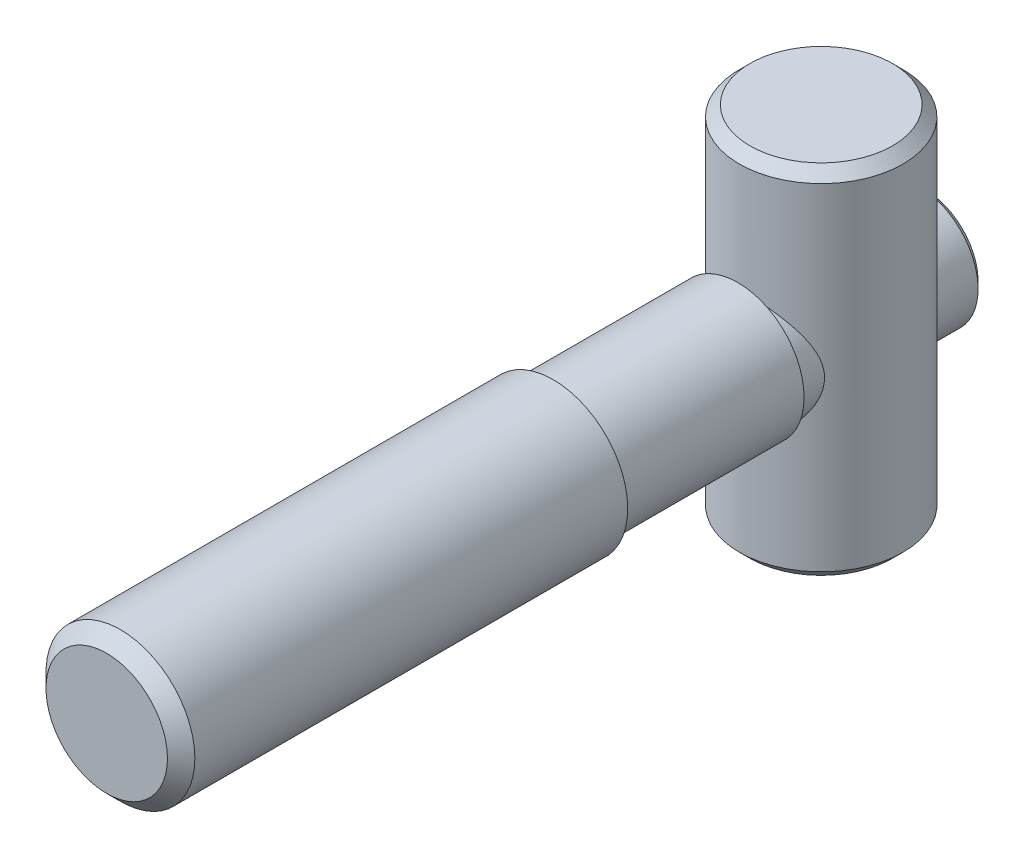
ISO-10303-21;
HEADER;
FILE_DESCRIPTION(('STEP AP214'),'2;1');
FILE_NAME('part.step','',(''),(''),'','','');
FILE_SCHEMA(('AUTOMOTIVE_DESIGN { 1 0 10303 214 1 1 1 1 }'));
ENDSEC;
DATA;
#1=APPLICATION_CONTEXT('core data for automotive mechanical design processes');
#2=APPLICATION_PROTOCOL_DEFINITION('international standard','automotive_design',2000,#1);
#3=PRODUCT_CONTEXT('',#1,'mechanical');
#4=PRODUCT('Part','Part','',(#3));
#5=PRODUCT_RELATED_PRODUCT_CATEGORY('part','',(#4));
#6=PRODUCT_DEFINITION_FORMATION('','',#4);
#7=PRODUCT_DEFINITION_CONTEXT('part definition',#1,'design');
#8=PRODUCT_DEFINITION('design','',#6,#7);
#9=PRODUCT_DEFINITION_SHAPE('','',#8);
#10=(LENGTH_UNIT() NAMED_UNIT(*) SI_UNIT(.MILLI.,.METRE.));
#11=(NAMED_UNIT(*) PLANE_ANGLE_UNIT() SI_UNIT($,.RADIAN.));
#12=(NAMED_UNIT(*) SI_UNIT($,.STERADIAN.) SOLID_ANGLE_UNIT());
#13=UNCERTAINTY_MEASURE_WITH_UNIT(LENGTH_MEASURE(1.E-05),#10,'distance_accuracy_value','');
#14=(GEOMETRIC_REPRESENTATION_CONTEXT(3) GLOBAL_UNCERTAINTY_ASSIGNED_CONTEXT((#13)) GLOBAL_UNIT_ASSIGNED_CONTEXT((#10,
#11,#12)) REPRESENTATION_CONTEXT('',''));
#15=CARTESIAN_POINT('',(0.,0.,0.));
#16=DIRECTION('',(0.,0.,1.));
#17=DIRECTION('',(1.,0.,0.));
#18=AXIS2_PLACEMENT_3D('',#15,#16,#17);
#19=CARTESIAN_POINT('',(0.,-12.,-18.3));
#20=DIRECTION('',(0.,-1.,0.));
#21=DIRECTION('',(-1.,0.,0.));
#22=AXIS2_PLACEMENT_3D('',#19,#20,#21);
#23=PLANE('',#22);
#24=CARTESIAN_POINT('',(0.,-12.,-18.3));
#25=DIRECTION('',(0.,-1.,0.));
#26=DIRECTION('',(-1.,0.,0.));
#27=AXIS2_PLACEMENT_3D('',#24,#25,#26);
#28=CIRCLE('',#27,4.79289321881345);
#29=CARTESIAN_POINT('',(-4.79289321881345,-12.,-18.3));
#30=VERTEX_POINT('',#29);
#31=EDGE_CURVE('E145',#30,#30,#28,.T.);
#32=ORIENTED_EDGE('',*,*,#31,.T.);
#33=EDGE_LOOP('',(#32));
#34=FACE_BOUND('',#33,.T.);
#35=ADVANCED_FACE('F14',(#34),#23,.T.);
#36=CARTESIAN_POINT('',(0.,12.,-18.3));
#37=DIRECTION('',(0.,1.,0.));
#38=DIRECTION('',(1.,0.,0.));
#39=AXIS2_PLACEMENT_3D('',#36,#37,#38);
#40=PLANE('',#39);
#41=CARTESIAN_POINT('',(0.,12.,-18.3));
#42=DIRECTION('',(0.,1.,0.));
#43=DIRECTION('',(1.,0.,0.));
#44=AXIS2_PLACEMENT_3D('',#41,#42,#43);
#45=CIRCLE('',#44,4.79289321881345);
#46=CARTESIAN_POINT('',(4.79289321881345,12.,-18.3));
#47=VERTEX_POINT('',#46);
#48=EDGE_CURVE('E9',#47,#47,#45,.T.);
#49=ORIENTED_EDGE('',*,*,#48,.T.);
#50=EDGE_LOOP('',(#49));
#51=FACE_BOUND('',#50,.T.);
#52=ADVANCED_FACE('F181',(#51),#40,.T.);
#53=CARTESIAN_POINT('',(0.,-12.,-18.3));
#54=DIRECTION('',(0.,1.,0.));
#55=DIRECTION('',(1.,0.,0.));
#56=AXIS2_PLACEMENT_3D('',#53,#54,#55);
#57=CONICAL_SURFACE('',#56,4.79289321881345,0.785398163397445);
#58=CARTESIAN_POINT('',(0.,-11.2928932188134,-18.3));
#59=DIRECTION('',(0.,-1.,0.));
#60=DIRECTION('',(-1.,0.,0.));
#61=AXIS2_PLACEMENT_3D('',#58,#59,#60);
#62=CIRCLE('',#61,5.5);
#63=CARTESIAN_POINT('',(-5.5,-11.2928932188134,-18.3));
#64=VERTEX_POINT('',#63);
#65=EDGE_CURVE('E23',#64,#64,#62,.F.);
#66=ORIENTED_EDGE('',*,*,#65,.F.);
#67=EDGE_LOOP('',(#66));
#68=FACE_BOUND('',#67,.T.);
#69=ORIENTED_EDGE('',*,*,#31,.F.);
#70=EDGE_LOOP('',(#69));
#71=FACE_BOUND('',#70,.T.);
#72=ADVANCED_FACE('F183',(#68,#71),#57,.T.);
#73=CARTESIAN_POINT('',(0.,12.,-18.3));
#74=DIRECTION('',(0.,-1.,0.));
#75=DIRECTION('',(-1.,0.,0.));
#76=AXIS2_PLACEMENT_3D('',#73,#74,#75);
#77=CONICAL_SURFACE('',#76,4.79289321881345,0.785398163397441);
#78=CARTESIAN_POINT('',(0.,11.2928932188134,-18.3));
#79=DIRECTION('',(0.,1.,0.));
#80=DIRECTION('',(1.,0.,0.));
#81=AXIS2_PLACEMENT_3D('',#78,#79,#80);
#82=CIRCLE('',#81,5.5);
#83=CARTESIAN_POINT('',(5.5,11.2928932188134,-18.3));
#84=VERTEX_POINT('',#83);
#85=EDGE_CURVE('E149',#84,#84,#82,.F.);
#86=ORIENTED_EDGE('',*,*,#85,.F.);
#87=EDGE_LOOP('',(#86));
#88=FACE_BOUND('',#87,.T.);
#89=ORIENTED_EDGE('',*,*,#48,.F.);
#90=EDGE_LOOP('',(#89));
#91=FACE_BOUND('',#90,.T.);
#92=ADVANCED_FACE('F174',(#88,#91),#77,.T.);
#93=CARTESIAN_POINT('',(0.,12.,-18.3));
#94=DIRECTION('',(0.,1.,0.));
#95=DIRECTION('',(1.,0.,0.));
#96=AXIS2_PLACEMENT_3D('',#93,#94,#95);
#97=CYLINDRICAL_SURFACE('',#96,5.5);
#98=DIRECTION('',(0.,1.,0.));
#99=VECTOR('',#98,1.);
#100=CARTESIAN_POINT('',(0.6,12.,-23.7671747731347));
#101=LINE('',#100,#99);
#102=CARTESIAN_POINT('',(0.6,-3.95474398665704,-23.7671747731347));
#103=VERTEX_POINT('',#102);
#104=CARTESIAN_POINT('',(0.6,3.95474398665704,-23.7671747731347));
#105=VERTEX_POINT('',#104);
#106=EDGE_CURVE('E81',#103,#105,#101,.T.);
#107=ORIENTED_EDGE('',*,*,#106,.F.);
#108=CARTESIAN_POINT('',(4.,0.,-22.0749172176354));
#109=CARTESIAN_POINT('',(3.99999971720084,0.094559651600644,-22.0749177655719));
#110=CARTESIAN_POINT('',(3.99663873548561,0.189122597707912,-22.078488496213));
#111=CARTESIAN_POINT('',(3.98328406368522,0.377297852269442,-22.0925637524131));
#112=CARTESIAN_POINT('',(3.97328671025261,0.470909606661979,-22.1030721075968));
#113=CARTESIAN_POINT('',(3.94687649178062,0.65648336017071,-22.1304732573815));
#114=CARTESIAN_POINT('',(3.93044906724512,0.748441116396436,-22.1473805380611));
#115=CARTESIAN_POINT('',(3.89152450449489,0.929870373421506,-22.1867470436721));
#116=CARTESIAN_POINT('',(3.86902376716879,1.01934036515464,-22.2092095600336));
#117=CARTESIAN_POINT('',(3.79365509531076,1.28093397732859,-22.2828450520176));
#118=CARTESIAN_POINT('',(3.73252985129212,1.44885844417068,-22.3407009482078));
#119=CARTESIAN_POINT('',(3.590688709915,1.77146295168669,-22.4672506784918));
#120=CARTESIAN_POINT('',(3.50997431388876,1.92614400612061,-22.5359436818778));
#121=CARTESIAN_POINT('',(3.31318173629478,2.25065582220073,-22.6922095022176));
#122=CARTESIAN_POINT('',(3.19328494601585,2.41764951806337,-22.7808675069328));
#123=CARTESIAN_POINT('',(2.92908108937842,2.73178094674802,-22.9578760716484));
#124=CARTESIAN_POINT('',(2.78474090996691,2.87889125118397,-23.0462260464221));
#125=CARTESIAN_POINT('',(2.5362822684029,3.09553636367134,-23.1814353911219));
#126=CARTESIAN_POINT('',(2.43963284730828,3.17231415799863,-23.2305740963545));
#127=CARTESIAN_POINT('',(2.23844845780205,3.31733570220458,-23.3251054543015));
#128=CARTESIAN_POINT('',(2.13391712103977,3.38558334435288,-23.3704998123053));
#129=CARTESIAN_POINT('',(1.91752007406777,3.51266692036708,-23.4562228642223));
#130=CARTESIAN_POINT('',(1.80566515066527,3.57151627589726,-23.49655876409));
#131=CARTESIAN_POINT('',(1.57523382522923,3.67896799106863,-23.5709873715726));
#132=CARTESIAN_POINT('',(1.45666071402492,3.72757531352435,-23.6050831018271));
#133=CARTESIAN_POINT('',(1.16188171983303,3.83193503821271,-23.678830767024));
#134=CARTESIAN_POINT('',(0.982606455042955,3.88193864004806,-23.7146815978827));
#135=CARTESIAN_POINT('',(0.616370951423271,3.95663720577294,-23.7684829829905));
#136=CARTESIAN_POINT('',(0.429417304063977,3.98135342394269,-23.7864485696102));
#137=CARTESIAN_POINT('',(0.052567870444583,4.00411402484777,-23.8029868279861));
#138=CARTESIAN_POINT('',(-0.137333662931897,4.00209732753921,-23.8015150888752));
#139=CARTESIAN_POINT('',(-0.51380986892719,3.97135939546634,-23.7791958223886));
#140=CARTESIAN_POINT('',(-0.700383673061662,3.94263129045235,-23.7583433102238));
#141=CARTESIAN_POINT('',(-1.05962164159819,3.86136821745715,-23.699944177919));
#142=CARTESIAN_POINT('',(-1.23253206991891,3.80954610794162,-23.6628980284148));
#143=CARTESIAN_POINT('',(-1.56671343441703,3.68473335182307,-23.5749694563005));
#144=CARTESIAN_POINT('',(-1.72798199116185,3.61173839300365,-23.5240842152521));
#145=CARTESIAN_POINT('',(-2.05370310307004,3.43803005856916,-23.4054456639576));
#146=CARTESIAN_POINT('',(-2.2165364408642,3.33514439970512,-23.3364494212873));
#147=CARTESIAN_POINT('',(-2.52348319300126,3.10940476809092,-23.189889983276));
#148=CARTESIAN_POINT('',(-2.66757825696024,2.98653148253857,-23.1123185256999));
#149=CARTESIAN_POINT('',(-2.96150593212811,2.69807007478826,-22.9383041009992));
#150=CARTESIAN_POINT('',(-3.10726104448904,2.52879913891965,-22.8410685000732));
#151=CARTESIAN_POINT('',(-3.36953999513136,2.16705523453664,-22.6499971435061));
#152=CARTESIAN_POINT('',(-3.48605965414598,1.97457895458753,-22.556161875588));
#153=CARTESIAN_POINT('',(-3.66526169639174,1.61165125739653,-22.402032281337));
#154=CARTESIAN_POINT('',(-3.73414032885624,1.44549066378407,-22.3388789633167));
#155=CARTESIAN_POINT('',(-3.84985589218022,1.10068331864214,-22.2287430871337));
#156=CARTESIAN_POINT('',(-3.89674227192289,0.922065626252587,-22.1817243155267));
#157=CARTESIAN_POINT('',(-3.9599937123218,0.585461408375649,-22.1170906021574));
#158=CARTESIAN_POINT('',(-3.98009730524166,0.428880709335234,-22.0959235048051));
#159=CARTESIAN_POINT('',(-4.00152507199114,0.113064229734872,-22.0733369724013));
#160=CARTESIAN_POINT('',(-4.00286519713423,-0.0461691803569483,-22.0719007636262));
#161=CARTESIAN_POINT('',(-3.98669865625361,-0.362327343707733,-22.0889767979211));
#162=CARTESIAN_POINT('',(-3.96921589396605,-0.519254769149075,-22.1074637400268));
#163=CARTESIAN_POINT('',(-3.91666535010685,-0.82717652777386,-22.1614916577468));
#164=CARTESIAN_POINT('',(-3.88157034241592,-0.978161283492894,-22.1970590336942));
#165=CARTESIAN_POINT('',(-3.77812999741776,-1.33113055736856,-22.2978469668));
#166=CARTESIAN_POINT('',(-3.70207893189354,-1.52906623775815,-22.3692423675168));
#167=CARTESIAN_POINT('',(-3.52270580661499,-1.90640842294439,-22.5254840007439));
#168=CARTESIAN_POINT('',(-3.41932922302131,-2.08577687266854,-22.6103569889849));
#169=CARTESIAN_POINT('',(-3.18411833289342,-2.43025180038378,-22.7870574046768));
#170=CARTESIAN_POINT('',(-3.05152555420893,-2.59477148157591,-22.8790168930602));
#171=CARTESIAN_POINT('',(-2.76125147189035,-2.90173861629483,-23.059699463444));
#172=CARTESIAN_POINT('',(-2.6035911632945,-3.04420434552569,-23.1484251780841));
#173=CARTESIAN_POINT('',(-2.271539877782,-3.2987599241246,-23.3122631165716));
#174=CARTESIAN_POINT('',(-2.09818660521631,-3.41190835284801,-23.3878018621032));
#175=CARTESIAN_POINT('',(-1.82330793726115,-3.56180731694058,-23.4899086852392));
#176=CARTESIAN_POINT('',(-1.72916099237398,-3.6084863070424,-23.5220894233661));
#177=CARTESIAN_POINT('',(-1.53632285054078,-3.69470582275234,-23.5820343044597));
#178=CARTESIAN_POINT('',(-1.43763386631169,-3.73424977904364,-23.6098005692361));
#179=CARTESIAN_POINT('',(-1.23534308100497,-3.80598862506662,-23.6604944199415));
#180=CARTESIAN_POINT('',(-1.13170490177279,-3.83811376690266,-23.683375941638));
#181=CARTESIAN_POINT('',(-0.921160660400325,-3.89401032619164,-23.7233693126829));
#182=CARTESIAN_POINT('',(-0.81425636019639,-3.9177861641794,-23.7404842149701));
#183=CARTESIAN_POINT('',(-0.598125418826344,-3.95655048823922,-23.7684652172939));
#184=CARTESIAN_POINT('',(-0.488900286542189,-3.9715445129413,-23.7793352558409));
#185=CARTESIAN_POINT('',(-0.269138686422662,-3.9924605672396,-23.7945144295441));
#186=CARTESIAN_POINT('',(-0.15860243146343,-3.99838404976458,-23.7988246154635));
#187=CARTESIAN_POINT('',(0.0467313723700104,-4.00084937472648,-23.8006178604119));
#188=CARTESIAN_POINT('',(0.141509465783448,-3.99861635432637,-23.7989924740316));
#189=CARTESIAN_POINT('',(0.330490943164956,-3.98744748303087,-23.7908762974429));
#190=CARTESIAN_POINT('',(0.424694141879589,-3.97850957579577,-23.7843840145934));
#191=CARTESIAN_POINT('',(0.611759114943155,-3.95406659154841,-23.7666782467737));
#192=CARTESIAN_POINT('',(0.704621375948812,-3.93856396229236,-23.7554665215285));
#193=CARTESIAN_POINT('',(0.88841574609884,-3.90122128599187,-23.7285691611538));
#194=CARTESIAN_POINT('',(0.979347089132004,-3.87937877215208,-23.7128817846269));
#195=CARTESIAN_POINT('',(1.24445933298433,-3.80583624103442,-23.6603363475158));
#196=CARTESIAN_POINT('',(1.41518501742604,-3.74554675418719,-23.6175701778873));
#197=CARTESIAN_POINT('',(1.74369677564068,-3.60438289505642,-23.5191022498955));
#198=CARTESIAN_POINT('',(1.90148075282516,-3.5235051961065,-23.4633984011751));
#199=CARTESIAN_POINT('',(2.22228203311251,-3.33179335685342,-23.3343972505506));
#200=CARTESIAN_POINT('',(2.38322541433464,-3.21841054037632,-23.2597469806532));
#201=CARTESIAN_POINT('',(2.68497920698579,-2.97136345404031,-23.103106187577));
#202=CARTESIAN_POINT('',(2.82576198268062,-2.8376718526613,-23.0211058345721));
#203=CARTESIAN_POINT('',(3.03332548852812,-2.61000808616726,-22.8888332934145));
#204=CARTESIAN_POINT('',(3.10699576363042,-2.5218601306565,-22.839152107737));
#205=CARTESIAN_POINT('',(3.24665706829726,-2.3393224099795,-22.7403298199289));
#206=CARTESIAN_POINT('',(3.31264615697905,-2.24493107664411,-22.69118885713));
#207=CARTESIAN_POINT('',(3.43660180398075,-2.0501419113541,-22.5948719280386));
#208=CARTESIAN_POINT('',(3.49457298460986,-1.94974758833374,-22.5476948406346));
#209=CARTESIAN_POINT('',(3.6021255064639,-1.74306577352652,-22.4568795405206));
#210=CARTESIAN_POINT('',(3.6517073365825,-1.63677862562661,-22.4132411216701));
#211=CARTESIAN_POINT('',(3.76078752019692,-1.37275858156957,-22.3142162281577));
#212=CARTESIAN_POINT('',(3.81580236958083,-1.21205137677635,-22.2615166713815));
#213=CARTESIAN_POINT('',(3.88309107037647,-0.963817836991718,-22.1952018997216));
#214=CARTESIAN_POINT('',(3.90296834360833,-0.879972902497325,-22.1752342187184));
#215=CARTESIAN_POINT('',(3.93739985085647,-0.710192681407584,-22.1402454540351));
#216=CARTESIAN_POINT('',(3.95195647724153,-0.62425835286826,-22.1252221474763));
#217=CARTESIAN_POINT('',(3.97571410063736,-0.449073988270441,-22.1005263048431));
#218=CARTESIAN_POINT('',(3.98480070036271,-0.359792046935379,-22.0909682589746));
#219=CARTESIAN_POINT('',(3.99694447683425,-0.180341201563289,-22.0781627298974));
#220=CARTESIAN_POINT('',(4.00000026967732,-0.0901720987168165,-22.0749166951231));
#221=CARTESIAN_POINT('',(4.,0.,-22.0749172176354));
#222=B_SPLINE_CURVE_WITH_KNOTS('',3,(#108,#109,#110,#111,#112,#113,#114,#115,#116,#117,#118,
#119,#120,#121,#122,#123,#124,#125,#126,#127,#128,#129,#130,#131,#132,#133,#134,#135,#136,#137,
#138,#139,#140,#141,#142,#143,#144,#145,#146,#147,#148,#149,#150,#151,#152,#153,#154,#155,#156,
#157,#158,#159,#160,#161,#162,#163,#164,#165,#166,#167,#168,#169,#170,#171,#172,#173,#174,#175,
#176,#177,#178,#179,#180,#181,#182,#183,#184,#185,#186,#187,#188,#189,#190,#191,#192,#193,#194,
#195,#196,#197,#198,#199,#200,#201,#202,#203,#204,#205,#206,#207,#208,#209,#210,#211,#212,#213,
#214,#215,#216,#217,#218,#219,#220,#221),.UNSPECIFIED.,.T.,.F.,(4,2,2,2,2,2,2,2,2,2,2,2,2,2,2,2,
2,2,2,2,2,2,2,2,2,2,2,2,2,2,2,2,2,2,2,2,2,2,2,2,2,2,2,2,2,2,2,2,2,2,2,2,2,2,2,2,4),(0.,
0.283560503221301,0.567277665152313,0.851640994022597,1.13617321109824,1.69729774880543,
2.25837929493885,2.92774006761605,3.59801497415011,3.99610080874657,4.39400433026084,
4.79133442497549,5.18847154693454,5.75445889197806,6.31997012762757,6.88677367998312,
7.45372305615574,8.00426875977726,8.5549266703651,9.16646484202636,9.77859745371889,
10.5066073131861,11.2347211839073,11.8047550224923,12.3735009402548,12.8491941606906,
13.3244829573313,13.7991688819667,14.2745908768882,14.94214771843,15.6110467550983,
16.2999460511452,16.9882713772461,17.6463931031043,17.9757519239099,18.3049519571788,
18.6371312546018,18.9691344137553,19.3009279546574,19.6326683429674,19.9167672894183,
20.2009534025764,20.4850336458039,20.7692245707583,21.3249022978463,21.8806698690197,
22.5100347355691,23.1402542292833,23.5154020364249,23.8906444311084,24.2656695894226,
24.6406728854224,25.1720162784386,25.4371121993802,25.7020887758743,25.9724300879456,
26.24283342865),.UNSPECIFIED.);
#223=EDGE_CURVE('E76',#103,#105,#222,.T.);
#224=ORIENTED_EDGE('',*,*,#223,.T.);
#225=EDGE_LOOP('',(#107,#224));
#226=FACE_BOUND('',#225,.T.);
#227=ORIENTED_EDGE('',*,*,#85,.T.);
#228=EDGE_LOOP('',(#227));
#229=FACE_BOUND('',#228,.T.);
#230=ORIENTED_EDGE('',*,*,#65,.T.);
#231=EDGE_LOOP('',(#230));
#232=FACE_BOUND('',#231,.T.);
#233=CARTESIAN_POINT('',(4.,0.,-14.5250827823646));
#234=CARTESIAN_POINT('',(3.99999971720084,-0.0945596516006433,-14.5250822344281));
#235=CARTESIAN_POINT('',(3.99663873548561,-0.189122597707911,-14.521511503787));
#236=CARTESIAN_POINT('',(3.98328406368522,-0.37729785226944,-14.5074362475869));
#237=CARTESIAN_POINT('',(3.97328671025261,-0.470909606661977,-14.4969278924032));
#238=CARTESIAN_POINT('',(3.94687649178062,-0.65648336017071,-14.4695267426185));
#239=CARTESIAN_POINT('',(3.93044906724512,-0.748441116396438,-14.4526194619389));
#240=CARTESIAN_POINT('',(3.89152450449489,-0.929870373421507,-14.4132529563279));
#241=CARTESIAN_POINT('',(3.86902376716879,-1.01934036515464,-14.3907904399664));
#242=CARTESIAN_POINT('',(3.79365509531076,-1.28093397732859,-14.3171549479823));
#243=CARTESIAN_POINT('',(3.73252985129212,-1.44885844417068,-14.2592990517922));
#244=CARTESIAN_POINT('',(3.590688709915,-1.7714629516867,-14.1327493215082));
#245=CARTESIAN_POINT('',(3.50997431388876,-1.92614400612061,-14.0640563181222));
#246=CARTESIAN_POINT('',(3.31318173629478,-2.25065582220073,-13.9077904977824));
#247=CARTESIAN_POINT('',(3.19328494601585,-2.41764951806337,-13.8191324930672));
#248=CARTESIAN_POINT('',(2.92908108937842,-2.73178094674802,-13.6421239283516));
#249=CARTESIAN_POINT('',(2.78474090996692,-2.87889125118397,-13.5537739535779));
#250=CARTESIAN_POINT('',(2.53628226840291,-3.09553636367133,-13.4185646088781));
#251=CARTESIAN_POINT('',(2.43963284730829,-3.17231415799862,-13.3694259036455));
#252=CARTESIAN_POINT('',(2.23844845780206,-3.31733570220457,-13.2748945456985));
#253=CARTESIAN_POINT('',(2.13391712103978,-3.38558334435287,-13.2295001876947));
#254=CARTESIAN_POINT('',(1.91752007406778,-3.51266692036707,-13.1437771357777));
#255=CARTESIAN_POINT('',(1.80566515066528,-3.57151627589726,-13.10344123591));
#256=CARTESIAN_POINT('',(1.57523382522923,-3.67896799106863,-13.0290126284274));
#257=CARTESIAN_POINT('',(1.45666071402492,-3.72757531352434,-12.9949168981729));
#258=CARTESIAN_POINT('',(1.16188171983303,-3.83193503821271,-12.921169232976));
#259=CARTESIAN_POINT('',(0.982606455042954,-3.88193864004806,-12.8853184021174));
#260=CARTESIAN_POINT('',(0.616370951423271,-3.95663720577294,-12.8315170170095));
#261=CARTESIAN_POINT('',(0.429417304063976,-3.98135342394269,-12.8135514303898));
#262=CARTESIAN_POINT('',(0.0525678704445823,-4.00411402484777,-12.7970131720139));
#263=CARTESIAN_POINT('',(-0.137333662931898,-4.00209732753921,-12.7984849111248));
#264=CARTESIAN_POINT('',(-0.51380986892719,-3.97135939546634,-12.8208041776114));
#265=CARTESIAN_POINT('',(-0.700383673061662,-3.94263129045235,-12.8416566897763));
#266=CARTESIAN_POINT('',(-1.05962164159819,-3.86136821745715,-12.900055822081));
#267=CARTESIAN_POINT('',(-1.23253206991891,-3.80954610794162,-12.9371019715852));
#268=CARTESIAN_POINT('',(-1.56671343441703,-3.68473335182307,-13.0250305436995));
#269=CARTESIAN_POINT('',(-1.72798199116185,-3.61173839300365,-13.0759157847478));
#270=CARTESIAN_POINT('',(-2.05370310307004,-3.43803005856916,-13.1945543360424));
#271=CARTESIAN_POINT('',(-2.2165364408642,-3.33514439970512,-13.2635505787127));
#272=CARTESIAN_POINT('',(-2.52348319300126,-3.10940476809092,-13.410110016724));
#273=CARTESIAN_POINT('',(-2.66757825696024,-2.98653148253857,-13.4876814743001));
#274=CARTESIAN_POINT('',(-2.96150593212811,-2.69807007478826,-13.6616958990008));
#275=CARTESIAN_POINT('',(-3.10726104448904,-2.52879913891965,-13.7589314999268));
#276=CARTESIAN_POINT('',(-3.36953999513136,-2.16705523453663,-13.9500028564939));
#277=CARTESIAN_POINT('',(-3.48605965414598,-1.97457895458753,-14.043838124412));
#278=CARTESIAN_POINT('',(-3.66526169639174,-1.61165125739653,-14.197967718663));
#279=CARTESIAN_POINT('',(-3.73414032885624,-1.44549066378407,-14.2611210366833));
#280=CARTESIAN_POINT('',(-3.84985589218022,-1.10068331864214,-14.3712569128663));
#281=CARTESIAN_POINT('',(-3.8967422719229,-0.922065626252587,-14.4182756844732));
#282=CARTESIAN_POINT('',(-3.95999371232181,-0.585461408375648,-14.4829093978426));
#283=CARTESIAN_POINT('',(-3.98009730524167,-0.428880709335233,-14.5040764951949));
#284=CARTESIAN_POINT('',(-4.00152507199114,-0.113064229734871,-14.5266630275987));
#285=CARTESIAN_POINT('',(-4.00286519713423,0.0461691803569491,-14.5280992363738));
#286=CARTESIAN_POINT('',(-3.98669865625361,0.362327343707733,-14.5110232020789));
#287=CARTESIAN_POINT('',(-3.96921589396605,0.519254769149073,-14.4925362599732));
#288=CARTESIAN_POINT('',(-3.91666535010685,0.827176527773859,-14.4385083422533));
#289=CARTESIAN_POINT('',(-3.88157034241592,0.978161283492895,-14.4029409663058));
#290=CARTESIAN_POINT('',(-3.77812999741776,1.33113055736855,-14.3021530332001));
#291=CARTESIAN_POINT('',(-3.70207893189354,1.52906623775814,-14.2307576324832));
#292=CARTESIAN_POINT('',(-3.522705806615,1.90640842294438,-14.0745159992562));
#293=CARTESIAN_POINT('',(-3.41932922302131,2.08577687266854,-13.9896430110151));
#294=CARTESIAN_POINT('',(-3.18411833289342,2.43025180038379,-13.8129425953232));
#295=CARTESIAN_POINT('',(-3.05152555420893,2.59477148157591,-13.7209831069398));
#296=CARTESIAN_POINT('',(-2.76125147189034,2.90173861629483,-13.540300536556));
#297=CARTESIAN_POINT('',(-2.6035911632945,3.04420434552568,-13.4515748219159));
#298=CARTESIAN_POINT('',(-2.271539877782,3.2987599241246,-13.2877368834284));
#299=CARTESIAN_POINT('',(-2.09818660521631,3.41190835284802,-13.2121981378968));
#300=CARTESIAN_POINT('',(-1.82330793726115,3.56180731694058,-13.1100913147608));
#301=CARTESIAN_POINT('',(-1.72916099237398,3.6084863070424,-13.0779105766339));
#302=CARTESIAN_POINT('',(-1.53632285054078,3.69470582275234,-13.0179656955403));
#303=CARTESIAN_POINT('',(-1.43763386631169,3.73424977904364,-12.990199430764));
#304=CARTESIAN_POINT('',(-1.23534308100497,3.80598862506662,-12.9395055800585));
#305=CARTESIAN_POINT('',(-1.13170490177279,3.83811376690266,-12.916624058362));
#306=CARTESIAN_POINT('',(-0.921160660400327,3.89401032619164,-12.8766306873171));
#307=CARTESIAN_POINT('',(-0.814256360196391,3.9177861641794,-12.8595157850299));
#308=CARTESIAN_POINT('',(-0.598125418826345,3.95655048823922,-12.8315347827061));
#309=CARTESIAN_POINT('',(-0.488900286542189,3.9715445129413,-12.8206647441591));
#310=CARTESIAN_POINT('',(-0.269138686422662,3.9924605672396,-12.8054855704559));
#311=CARTESIAN_POINT('',(-0.158602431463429,3.99838404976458,-12.8011753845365));
#312=CARTESIAN_POINT('',(0.046731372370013,4.00084937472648,-12.7993821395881));
#313=CARTESIAN_POINT('',(0.141509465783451,3.99861635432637,-12.8010075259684));
#314=CARTESIAN_POINT('',(0.330490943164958,3.98744748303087,-12.8091237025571));
#315=CARTESIAN_POINT('',(0.424694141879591,3.97850957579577,-12.8156159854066));
#316=CARTESIAN_POINT('',(0.611759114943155,3.95406659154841,-12.8333217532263));
#317=CARTESIAN_POINT('',(0.704621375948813,3.93856396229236,-12.8445334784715));
#318=CARTESIAN_POINT('',(0.88841574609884,3.90122128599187,-12.8714308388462));
#319=CARTESIAN_POINT('',(0.979347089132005,3.87937877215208,-12.8871182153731));
#320=CARTESIAN_POINT('',(1.24445933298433,3.80583624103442,-12.9396636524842));
#321=CARTESIAN_POINT('',(1.41518501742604,3.74554675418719,-12.9824298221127));
#322=CARTESIAN_POINT('',(1.74369677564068,3.60438289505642,-13.0808977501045));
#323=CARTESIAN_POINT('',(1.90148075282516,3.5235051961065,-13.1366015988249));
#324=CARTESIAN_POINT('',(2.22228203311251,3.33179335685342,-13.2656027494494));
#325=CARTESIAN_POINT('',(2.38322541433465,3.21841054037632,-13.3402530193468));
#326=CARTESIAN_POINT('',(2.68497920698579,2.97136345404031,-13.496893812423));
#327=CARTESIAN_POINT('',(2.82576198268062,2.8376718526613,-13.5788941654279));
#328=CARTESIAN_POINT('',(3.03332548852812,2.61000808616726,-13.7111667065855));
#329=CARTESIAN_POINT('',(3.10699576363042,2.5218601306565,-13.760847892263));
#330=CARTESIAN_POINT('',(3.24665706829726,2.33932240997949,-13.8596701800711));
#331=CARTESIAN_POINT('',(3.31264615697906,2.24493107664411,-13.9088111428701));
#332=CARTESIAN_POINT('',(3.43660180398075,2.05014191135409,-14.0051280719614));
#333=CARTESIAN_POINT('',(3.49457298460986,1.94974758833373,-14.0523051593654));
#334=CARTESIAN_POINT('',(3.60212550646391,1.74306577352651,-14.1431204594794));
#335=CARTESIAN_POINT('',(3.65170733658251,1.6367786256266,-14.18675887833));
#336=CARTESIAN_POINT('',(3.76078752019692,1.37275858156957,-14.2857837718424));
#337=CARTESIAN_POINT('',(3.81580236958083,1.21205137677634,-14.3384833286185));
#338=CARTESIAN_POINT('',(3.88309107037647,0.963817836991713,-14.4047981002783));
#339=CARTESIAN_POINT('',(3.90296834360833,0.879972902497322,-14.4247657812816));
#340=CARTESIAN_POINT('',(3.93739985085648,0.71019268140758,-14.4597545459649));
#341=CARTESIAN_POINT('',(3.95195647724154,0.624258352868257,-14.4747778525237));
#342=CARTESIAN_POINT('',(3.97571410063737,0.449073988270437,-14.4994736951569));
#343=CARTESIAN_POINT('',(3.98480070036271,0.359792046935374,-14.5090317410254));
#344=CARTESIAN_POINT('',(3.99694447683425,0.180341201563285,-14.5218372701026));
#345=CARTESIAN_POINT('',(4.00000026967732,0.0901720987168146,-14.525083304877));
#346=CARTESIAN_POINT('',(4.,0.,-14.5250827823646));
#347=B_SPLINE_CURVE_WITH_KNOTS('',3,(#233,#234,#235,#236,#237,#238,#239,#240,#241,#242,#243,
#244,#245,#246,#247,#248,#249,#250,#251,#252,#253,#254,#255,#256,#257,#258,#259,#260,#261,#262,
#263,#264,#265,#266,#267,#268,#269,#270,#271,#272,#273,#274,#275,#276,#277,#278,#279,#280,#281,
#282,#283,#284,#285,#286,#287,#288,#289,#290,#291,#292,#293,#294,#295,#296,#297,#298,#299,#300,
#301,#302,#303,#304,#305,#306,#307,#308,#309,#310,#311,#312,#313,#314,#315,#316,#317,#318,#319,
#320,#321,#322,#323,#324,#325,#326,#327,#328,#329,#330,#331,#332,#333,#334,#335,#336,#337,#338,
#339,#340,#341,#342,#343,#344,#345,#346),.UNSPECIFIED.,.T.,.F.,(4,2,2,2,2,2,2,2,2,2,2,2,2,2,2,2,
2,2,2,2,2,2,2,2,2,2,2,2,2,2,2,2,2,2,2,2,2,2,2,2,2,2,2,2,2,2,2,2,2,2,2,2,2,2,2,2,4),(0.,
0.2835605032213,0.567277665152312,0.851640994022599,1.13617321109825,1.69729774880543,
2.25837929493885,2.92774006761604,3.59801497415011,3.99610080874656,4.39400433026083,
4.79133442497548,5.18847154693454,5.75445889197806,6.31997012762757,6.88677367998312,
7.45372305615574,8.00426875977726,8.5549266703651,9.16646484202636,9.77859745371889,
10.5066073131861,11.2347211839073,11.8047550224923,12.3735009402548,12.8491941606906,
13.3244829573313,13.7991688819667,14.2745908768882,14.94214771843,15.6110467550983,
16.2999460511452,16.9882713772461,17.6463931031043,17.9757519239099,18.3049519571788,
18.6371312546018,18.9691344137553,19.3009279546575,19.6326683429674,19.9167672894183,
20.2009534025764,20.4850336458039,20.7692245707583,21.3249022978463,21.8806698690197,
22.5100347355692,23.1402542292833,23.5154020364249,23.8906444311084,24.2656695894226,
24.6406728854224,25.1720162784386,25.4371121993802,25.7020887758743,25.9724300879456,
26.24283342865),.UNSPECIFIED.);
#348=CARTESIAN_POINT('',(4.,0.,-14.5250827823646));
#349=VERTEX_POINT('',#348);
#350=EDGE_CURVE('E164',#349,#349,#347,.T.);
#351=ORIENTED_EDGE('',*,*,#350,.T.);
#352=EDGE_LOOP('',(#351));
#353=FACE_BOUND('',#352,.T.);
#354=CARTESIAN_POINT('',(-0.6,3.95474398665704,-23.7671747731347));
#355=VERTEX_POINT('',#354);
#356=CARTESIAN_POINT('',(-0.6,-3.95474398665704,-23.7671747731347));
#357=VERTEX_POINT('',#356);
#358=EDGE_CURVE('E66',#355,#357,#222,.T.);
#359=ORIENTED_EDGE('',*,*,#358,.T.);
#360=DIRECTION('',(0.,1.,0.));
#361=VECTOR('',#360,1.);
#362=CARTESIAN_POINT('',(-0.6,12.,-23.7671747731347));
#363=LINE('',#362,#361);
#364=EDGE_CURVE('E77',#357,#355,#363,.T.);
#365=ORIENTED_EDGE('',*,*,#364,.T.);
#366=EDGE_LOOP('',(#359,#365));
#367=FACE_BOUND('',#366,.T.);
#368=ADVANCED_FACE('F79',(#226,#229,#232,#353,#367),#97,.T.);
#369=CARTESIAN_POINT('',(0.,0.,24.7));
#370=DIRECTION('',(0.,0.,1.));
#371=DIRECTION('',(1.,0.,0.));
#372=AXIS2_PLACEMENT_3D('',#369,#370,#371);
#373=CYLINDRICAL_SURFACE('',#372,5.);
#374=CARTESIAN_POINT('',(0.,0.,-0.300000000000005));
#375=DIRECTION('',(0.,0.,1.));
#376=DIRECTION('',(1.,0.,0.));
#377=AXIS2_PLACEMENT_3D('',#374,#375,#376);
#378=CIRCLE('',#377,5.);
#379=CARTESIAN_POINT('',(5.,0.,-0.300000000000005));
#380=VERTEX_POINT('',#379);
#381=EDGE_CURVE('E105',#380,#380,#378,.T.);
#382=ORIENTED_EDGE('',*,*,#381,.T.);
#383=EDGE_LOOP('',(#382));
#384=FACE_BOUND('',#383,.T.);
#385=CARTESIAN_POINT('',(0.,0.,28.78));
#386=DIRECTION('',(0.,0.,1.));
#387=DIRECTION('',(1.,0.,0.));
#388=AXIS2_PLACEMENT_3D('',#385,#386,#387);
#389=CIRCLE('',#388,5.);
#390=CARTESIAN_POINT('',(5.,0.,28.78));
#391=VERTEX_POINT('',#390);
#392=EDGE_CURVE('E215',#391,#391,#389,.T.);
#393=ORIENTED_EDGE('',*,*,#392,.F.);
#394=EDGE_LOOP('',(#393));
#395=FACE_BOUND('',#394,.T.);
#396=ADVANCED_FACE('F134',(#384,#395),#373,.T.);
#397=CARTESIAN_POINT('',(0.,0.,-0.300000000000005));
#398=DIRECTION('',(0.,0.,1.));
#399=DIRECTION('',(1.,0.,0.));
#400=AXIS2_PLACEMENT_3D('',#397,#398,#399);
#401=PLANE('',#400);
#402=ORIENTED_EDGE('',*,*,#381,.F.);
#403=EDGE_LOOP('',(#402));
#404=FACE_BOUND('',#403,.T.);
#405=CARTESIAN_POINT('',(0.,0.,-0.300000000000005));
#406=DIRECTION('',(0.,0.,1.));
#407=DIRECTION('',(1.,0.,0.));
#408=AXIS2_PLACEMENT_3D('',#405,#406,#407);
#409=CIRCLE('',#408,4.45);
#410=CARTESIAN_POINT('',(4.45,0.,-0.300000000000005));
#411=VERTEX_POINT('',#410);
#412=EDGE_CURVE('E102',#411,#411,#409,.T.);
#413=ORIENTED_EDGE('',*,*,#412,.T.);
#414=EDGE_LOOP('',(#413));
#415=FACE_BOUND('',#414,.T.);
#416=ADVANCED_FACE('F275',(#404,#415),#401,.F.);
#417=CARTESIAN_POINT('',(0.,0.,-0.300000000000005));
#418=DIRECTION('',(0.,0.,1.));
#419=DIRECTION('',(1.,0.,0.));
#420=AXIS2_PLACEMENT_3D('',#417,#418,#419);
#421=CYLINDRICAL_SURFACE('',#420,4.45);
#422=ORIENTED_EDGE('',*,*,#412,.F.);
#423=EDGE_LOOP('',(#422));
#424=FACE_BOUND('',#423,.T.);
#425=CARTESIAN_POINT('',(0.,0.,-12.7));
#426=DIRECTION('',(0.,0.,-1.));
#427=DIRECTION('',(-1.,0.,0.));
#428=AXIS2_PLACEMENT_3D('',#425,#426,#427);
#429=CIRCLE('',#428,4.45);
#430=CARTESIAN_POINT('',(-4.45,0.,-12.7));
#431=VERTEX_POINT('',#430);
#432=EDGE_CURVE('E140',#431,#431,#429,.T.);
#433=ORIENTED_EDGE('',*,*,#432,.F.);
#434=EDGE_LOOP('',(#433));
#435=FACE_BOUND('',#434,.T.);
#436=ADVANCED_FACE('F284',(#424,#435),#421,.T.);
#437=CARTESIAN_POINT('',(0.,0.,-12.7));
#438=DIRECTION('',(0.,0.,-1.));
#439=DIRECTION('',(-1.,0.,0.));
#440=AXIS2_PLACEMENT_3D('',#437,#438,#439);
#441=PLANE('',#440);
#442=CARTESIAN_POINT('',(0.,0.,-12.7));
#443=DIRECTION('',(0.,0.,-1.));
#444=DIRECTION('',(-1.,0.,0.));
#445=AXIS2_PLACEMENT_3D('',#442,#443,#444);
#446=CIRCLE('',#445,4.);
#447=CARTESIAN_POINT('',(-4.,0.,-12.7));
#448=VERTEX_POINT('',#447);
#449=EDGE_CURVE('E18',#448,#448,#446,.T.);
#450=ORIENTED_EDGE('',*,*,#449,.F.);
#451=EDGE_LOOP('',(#450));
#452=FACE_BOUND('',#451,.T.);
#453=ORIENTED_EDGE('',*,*,#432,.T.);
#454=EDGE_LOOP('',(#453));
#455=FACE_BOUND('',#454,.T.);
#456=ADVANCED_FACE('F16',(#452,#455),#441,.T.);
#457=CARTESIAN_POINT('',(0.,0.,-12.8));
#458=DIRECTION('',(0.,0.,1.));
#459=DIRECTION('',(1.,0.,0.));
#460=AXIS2_PLACEMENT_3D('',#457,#458,#459);
#461=CYLINDRICAL_SURFACE('',#460,4.);
#462=ORIENTED_EDGE('',*,*,#449,.T.);
#463=EDGE_LOOP('',(#462));
#464=FACE_BOUND('',#463,.T.);
#465=ORIENTED_EDGE('',*,*,#350,.F.);
#466=EDGE_LOOP('',(#465));
#467=FACE_BOUND('',#466,.T.);
#468=ADVANCED_FACE('F198',(#464,#467),#461,.T.);
#469=CARTESIAN_POINT('',(0.,0.,-25.3));
#470=DIRECTION('',(0.,0.,1.));
#471=DIRECTION('',(1.,0.,0.));
#472=AXIS2_PLACEMENT_3D('',#469,#470,#471);
#473=PLANE('',#472);
#474=DIRECTION('',(0.,-1.,0.));
#475=VECTOR('',#474,1.);
#476=CARTESIAN_POINT('',(0.6,0.,-25.3));
#477=LINE('',#476,#475);
#478=CARTESIAN_POINT('',(0.6,3.48878202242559,-25.3));
#479=VERTEX_POINT('',#478);
#480=CARTESIAN_POINT('',(0.6,-3.48878202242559,-25.3));
#481=VERTEX_POINT('',#480);
#482=EDGE_CURVE('E119',#479,#481,#477,.T.);
#483=ORIENTED_EDGE('',*,*,#482,.F.);
#484=CARTESIAN_POINT('',(0.,0.,-25.3));
#485=DIRECTION('',(0.,0.,1.));
#486=DIRECTION('',(1.,0.,0.));
#487=AXIS2_PLACEMENT_3D('',#484,#485,#486);
#488=CIRCLE('',#487,3.54);
#489=EDGE_CURVE('E95',#481,#479,#488,.T.);
#490=ORIENTED_EDGE('',*,*,#489,.F.);
#491=EDGE_LOOP('',(#483,#490));
#492=FACE_BOUND('',#491,.T.);
#493=ADVANCED_FACE('F188',(#492),#473,.F.);
#494=CARTESIAN_POINT('',(0.,0.,-25.3));
#495=DIRECTION('',(0.,0.,1.));
#496=DIRECTION('',(1.,0.,0.));
#497=AXIS2_PLACEMENT_3D('',#494,#495,#496);
#498=CONICAL_SURFACE('',#497,3.54,0.785398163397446);
#499=CARTESIAN_POINT('',(0.6,3.9554519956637,-24.8393));
#500=CARTESIAN_POINT('',(0.6,3.83941046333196,-24.9540237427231));
#501=CARTESIAN_POINT('',(0.6,3.72331727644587,-25.0686953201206));
#502=CARTESIAN_POINT('',(0.6,3.49091447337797,-25.2979511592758));
#503=CARTESIAN_POINT('',(0.6,3.37460477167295,-25.4125353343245));
#504=CARTESIAN_POINT('',(0.6,3.14054409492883,-25.642725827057));
#505=CARTESIAN_POINT('',(0.6,3.02279099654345,-25.7583299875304));
#506=CARTESIAN_POINT('',(0.6,2.78706506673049,-25.9891808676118));
#507=CARTESIAN_POINT('',(0.6,2.66909239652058,-26.1044277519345));
#508=CARTESIAN_POINT('',(0.6,2.38769992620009,-26.3783597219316));
#509=CARTESIAN_POINT('',(0.6,2.2240974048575,-26.536857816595));
#510=CARTESIAN_POINT('',(0.6,1.97745696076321,-26.7736454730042));
#511=CARTESIAN_POINT('',(0.6,1.89495476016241,-26.8524926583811));
#512=CARTESIAN_POINT('',(0.6,1.72944434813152,-27.0096193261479));
#513=CARTESIAN_POINT('',(0.6,1.64643625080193,-27.0878989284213));
#514=CARTESIAN_POINT('',(0.6,1.48033289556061,-27.2429690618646));
#515=CARTESIAN_POINT('',(0.6,1.39724415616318,-27.319766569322));
#516=CARTESIAN_POINT('',(0.6,1.2297853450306,-27.4721053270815));
#517=CARTESIAN_POINT('',(0.6,1.14541426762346,-27.5476454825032));
#518=CARTESIAN_POINT('',(0.6,1.01743134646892,-27.6590099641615));
#519=CARTESIAN_POINT('',(0.6,0.974611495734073,-27.6957423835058));
#520=CARTESIAN_POINT('',(0.6,0.88825104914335,-27.7683476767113));
#521=CARTESIAN_POINT('',(0.6,0.844710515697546,-27.8042206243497));
#522=CARTESIAN_POINT('',(0.6,0.756681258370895,-27.8746657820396));
#523=CARTESIAN_POINT('',(0.6,0.712193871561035,-27.9092396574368));
#524=CARTESIAN_POINT('',(0.6,0.621791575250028,-27.9764590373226));
#525=CARTESIAN_POINT('',(0.6,0.575877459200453,-28.0091055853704));
#526=CARTESIAN_POINT('',(0.6,0.517059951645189,-28.0479937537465));
#527=CARTESIAN_POINT('',(0.6,0.505142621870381,-28.0557273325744));
#528=CARTESIAN_POINT('',(0.6,0.481156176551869,-28.0709583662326));
#529=CARTESIAN_POINT('',(0.6,0.469087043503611,-28.0784557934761));
#530=CARTESIAN_POINT('',(0.6,0.432629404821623,-28.1005451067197));
#531=CARTESIAN_POINT('',(0.6,0.407992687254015,-28.1147326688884));
#532=CARTESIAN_POINT('',(0.6,0.358127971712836,-28.1415606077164));
#533=CARTESIAN_POINT('',(0.6,0.332906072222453,-28.1542121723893));
#534=CARTESIAN_POINT('',(0.6,0.28159268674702,-28.1776006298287));
#535=CARTESIAN_POINT('',(0.6,0.255501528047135,-28.1883382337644));
#536=CARTESIAN_POINT('',(0.6,0.19385499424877,-28.2103112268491));
#537=CARTESIAN_POINT('',(0.6,0.157946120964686,-28.2206034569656));
#538=CARTESIAN_POINT('',(0.6,0.0849893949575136,-28.2350528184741));
#539=CARTESIAN_POINT('',(0.6,0.0479465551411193,-28.2392338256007));
#540=CARTESIAN_POINT('',(0.6,-0.0264554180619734,-28.2405737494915));
#541=CARTESIAN_POINT('',(0.6,-0.0638152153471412,-28.237698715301));
#542=CARTESIAN_POINT('',(0.6,-0.137530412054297,-28.2255268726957));
#543=CARTESIAN_POINT('',(0.6,-0.173882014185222,-28.2162085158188));
#544=CARTESIAN_POINT('',(0.6,-0.246261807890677,-28.1923675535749));
#545=CARTESIAN_POINT('',(0.6,-0.282227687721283,-28.1776642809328));
#546=CARTESIAN_POINT('',(0.6,-0.352560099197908,-28.1447807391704));
#547=CARTESIAN_POINT('',(0.6,-0.386923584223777,-28.1265941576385));
#548=CARTESIAN_POINT('',(0.6,-0.454569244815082,-28.0877625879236));
#549=CARTESIAN_POINT('',(0.6,-0.487840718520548,-28.0670992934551));
#550=CARTESIAN_POINT('',(0.6,-0.553299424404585,-28.024199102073));
#551=CARTESIAN_POINT('',(0.6,-0.585487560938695,-28.0019635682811));
#552=CARTESIAN_POINT('',(0.6,-0.651811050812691,-27.9544053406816));
#553=CARTESIAN_POINT('',(0.6,-0.685873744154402,-27.928982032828));
#554=CARTESIAN_POINT('',(0.6,-0.753285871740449,-27.8772035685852));
#555=CARTESIAN_POINT('',(0.6,-0.786635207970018,-27.8508482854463));
#556=CARTESIAN_POINT('',(0.6,-0.885905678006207,-27.7707557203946));
#557=CARTESIAN_POINT('',(0.6,-0.951015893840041,-27.7160164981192));
#558=CARTESIAN_POINT('',(0.6,-1.08003348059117,-27.6049240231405));
#559=CARTESIAN_POINT('',(0.6,-1.14393845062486,-27.5485680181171));
#560=CARTESIAN_POINT('',(0.6,-1.27086154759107,-27.4349047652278));
#561=CARTESIAN_POINT('',(0.6,-1.3338799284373,-27.3775978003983));
#562=CARTESIAN_POINT('',(0.6,-1.4591376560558,-27.2625095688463));
#563=CARTESIAN_POINT('',(0.6,-1.52137875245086,-27.2047301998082));
#564=CARTESIAN_POINT('',(0.6,-1.64544200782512,-27.0887149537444));
#565=CARTESIAN_POINT('',(0.6,-1.70726413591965,-27.0304790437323));
#566=CARTESIAN_POINT('',(0.6,-1.89214348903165,-26.8554033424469));
#567=CARTESIAN_POINT('',(0.6,-2.01474045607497,-26.738078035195));
#568=CARTESIAN_POINT('',(0.6,-2.28982158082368,-26.4732317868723));
#569=CARTESIAN_POINT('',(0.6,-2.44210553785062,-26.3255035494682));
#570=CARTESIAN_POINT('',(0.6,-2.74608630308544,-26.0293359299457));
#571=CARTESIAN_POINT('',(0.6,-2.89778288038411,-25.8808963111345));
#572=CARTESIAN_POINT('',(0.6,-3.20065551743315,-25.5837234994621));
#573=CARTESIAN_POINT('',(0.6,-3.35183189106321,-25.4349906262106));
#574=CARTESIAN_POINT('',(0.6,-3.653848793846,-25.1372979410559));
#575=CARTESIAN_POINT('',(0.6,-3.80468942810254,-24.9883382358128));
#576=CARTESIAN_POINT('',(0.6,-3.9554519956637,-24.8393));
#577=B_SPLINE_CURVE_WITH_KNOTS('',3,(#499,#500,#501,#502,#503,#504,#505,#506,#507,#508,#509,
#510,#511,#512,#513,#514,#515,#516,#517,#518,#519,#520,#521,#522,#523,#524,#525,#526,#527,#528,
#529,#530,#531,#532,#533,#534,#535,#536,#537,#538,#539,#540,#541,#542,#543,#544,#545,#546,#547,
#548,#549,#550,#551,#552,#553,#554,#555,#556,#557,#558,#559,#560,#561,#562,#563,#564,#565,#566,
#567,#568,#569,#570,#571,#572,#573,#574,#575,#576),.UNSPECIFIED.,.F.,.F.,(4,2,2,2,2,2,2,2,2,2,2,
2,2,2,2,2,2,2,2,2,2,2,2,2,2,2,2,2,2,2,2,2,2,2,2,2,2,2,4),(0.,0.489535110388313,
0.979348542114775,1.47439453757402,1.96916156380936,2.65251943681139,2.99487953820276,
3.33716508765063,3.6765918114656,4.01630008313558,4.18554223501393,4.35476980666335,
4.5237724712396,4.69268277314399,4.73530049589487,4.77792317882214,4.86317585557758,
4.94776464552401,5.03232193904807,5.14397626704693,5.25519319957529,5.36694631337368,
5.47907498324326,5.5953739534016,5.71188570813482,5.82931897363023,5.94665164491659,
6.07414183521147,6.20164943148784,6.45678921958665,6.71239265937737,6.96792134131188,
7.22269628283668,7.47748980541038,7.98655823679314,8.62305059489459,9.25977190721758,
9.89599619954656,10.5319807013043),.UNSPECIFIED.);
#578=CARTESIAN_POINT('',(0.6,3.95474398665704,-24.84));
#579=VERTEX_POINT('',#578);
#580=EDGE_CURVE('E35',#579,#479,#577,.T.);
#581=ORIENTED_EDGE('',*,*,#580,.F.);
#582=CARTESIAN_POINT('',(0.,0.,-24.84));
#583=DIRECTION('',(0.,0.,1.));
#584=DIRECTION('',(1.,0.,0.));
#585=AXIS2_PLACEMENT_3D('',#582,#583,#584);
#586=CIRCLE('',#585,4.);
#587=CARTESIAN_POINT('',(0.6,-3.95474398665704,-24.84));
#588=VERTEX_POINT('',#587);
#589=EDGE_CURVE('E99',#588,#579,#586,.T.);
#590=ORIENTED_EDGE('',*,*,#589,.F.);
#591=EDGE_CURVE('E118',#481,#588,#577,.T.);
#592=ORIENTED_EDGE('',*,*,#591,.F.);
#593=ORIENTED_EDGE('',*,*,#489,.T.);
#594=EDGE_LOOP('',(#581,#590,#592,#593));
#595=FACE_BOUND('',#594,.T.);
#596=ADVANCED_FACE('F133',(#595),#498,.T.);
#597=CARTESIAN_POINT('',(0.6,0.,-54.8));
#598=DIRECTION('',(-1.,0.,0.));
#599=DIRECTION('',(0.,1.,0.));
#600=AXIS2_PLACEMENT_3D('',#597,#598,#599);
#601=PLANE('',#600);
#602=DIRECTION('',(0.,0.,1.));
#603=VECTOR('',#602,1.);
#604=CARTESIAN_POINT('',(0.6,-3.95474398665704,-12.8));
#605=LINE('',#604,#603);
#606=EDGE_CURVE('E87',#588,#103,#605,.T.);
#607=ORIENTED_EDGE('',*,*,#606,.T.);
#608=ORIENTED_EDGE('',*,*,#106,.T.);
#609=DIRECTION('',(0.,0.,1.));
#610=VECTOR('',#609,1.);
#611=CARTESIAN_POINT('',(0.6,3.95474398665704,-12.8));
#612=LINE('',#611,#610);
#613=EDGE_CURVE('E31',#105,#579,#612,.F.);
#614=ORIENTED_EDGE('',*,*,#613,.T.);
#615=ORIENTED_EDGE('',*,*,#580,.T.);
#616=ORIENTED_EDGE('',*,*,#482,.T.);
#617=ORIENTED_EDGE('',*,*,#591,.T.);
#618=EDGE_LOOP('',(#607,#608,#614,#615,#616,#617));
#619=FACE_BOUND('',#618,.T.);
#620=ADVANCED_FACE('F129',(#619),#601,.T.);
#621=ORIENTED_EDGE('',*,*,#223,.F.);
#622=ORIENTED_EDGE('',*,*,#606,.F.);
#623=ORIENTED_EDGE('',*,*,#589,.T.);
#624=ORIENTED_EDGE('',*,*,#613,.F.);
#625=EDGE_LOOP('',(#621,#622,#623,#624));
#626=FACE_BOUND('',#625,.T.);
#627=ADVANCED_FACE('F128',(#626),#461,.T.);
#628=CARTESIAN_POINT('',(-0.6,0.,-54.8));
#629=DIRECTION('',(-1.,0.,0.));
#630=DIRECTION('',(0.,1.,0.));
#631=AXIS2_PLACEMENT_3D('',#628,#629,#630);
#632=PLANE('',#631);
#633=ORIENTED_EDGE('',*,*,#364,.F.);
#634=DIRECTION('',(0.,0.,1.));
#635=VECTOR('',#634,1.);
#636=CARTESIAN_POINT('',(-0.6,-3.95474398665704,-12.8));
#637=LINE('',#636,#635);
#638=CARTESIAN_POINT('',(-0.6,-3.95474398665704,-24.84));
#639=VERTEX_POINT('',#638);
#640=EDGE_CURVE('E73',#639,#357,#637,.T.);
#641=ORIENTED_EDGE('',*,*,#640,.F.);
#642=CARTESIAN_POINT('',(-0.6,3.9554519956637,-24.8393));
#643=CARTESIAN_POINT('',(-0.6,3.83941046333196,-24.9540237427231));
#644=CARTESIAN_POINT('',(-0.6,3.72331727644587,-25.0686953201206));
#645=CARTESIAN_POINT('',(-0.6,3.49091447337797,-25.2979511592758));
#646=CARTESIAN_POINT('',(-0.6,3.37460477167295,-25.4125353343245));
#647=CARTESIAN_POINT('',(-0.6,3.14054409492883,-25.642725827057));
#648=CARTESIAN_POINT('',(-0.6,3.02279099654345,-25.7583299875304));
#649=CARTESIAN_POINT('',(-0.6,2.78706506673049,-25.9891808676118));
#650=CARTESIAN_POINT('',(-0.6,2.66909239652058,-26.1044277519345));
#651=CARTESIAN_POINT('',(-0.6,2.38769992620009,-26.3783597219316));
#652=CARTESIAN_POINT('',(-0.6,2.2240974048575,-26.536857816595));
#653=CARTESIAN_POINT('',(-0.6,1.97745696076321,-26.7736454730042));
#654=CARTESIAN_POINT('',(-0.6,1.89495476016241,-26.8524926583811));
#655=CARTESIAN_POINT('',(-0.6,1.72944434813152,-27.0096193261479));
#656=CARTESIAN_POINT('',(-0.6,1.64643625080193,-27.0878989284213));
#657=CARTESIAN_POINT('',(-0.6,1.48033289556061,-27.2429690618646));
#658=CARTESIAN_POINT('',(-0.6,1.39724415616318,-27.319766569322));
#659=CARTESIAN_POINT('',(-0.6,1.2297853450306,-27.4721053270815));
#660=CARTESIAN_POINT('',(-0.6,1.14541426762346,-27.5476454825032));
#661=CARTESIAN_POINT('',(-0.6,1.01743134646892,-27.6590099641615));
#662=CARTESIAN_POINT('',(-0.6,0.974611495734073,-27.6957423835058));
#663=CARTESIAN_POINT('',(-0.6,0.88825104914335,-27.7683476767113));
#664=CARTESIAN_POINT('',(-0.6,0.844710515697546,-27.8042206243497));
#665=CARTESIAN_POINT('',(-0.6,0.756681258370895,-27.8746657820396));
#666=CARTESIAN_POINT('',(-0.6,0.712193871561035,-27.9092396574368));
#667=CARTESIAN_POINT('',(-0.6,0.621791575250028,-27.9764590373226));
#668=CARTESIAN_POINT('',(-0.6,0.575877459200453,-28.0091055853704));
#669=CARTESIAN_POINT('',(-0.6,0.517059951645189,-28.0479937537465));
#670=CARTESIAN_POINT('',(-0.6,0.505142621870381,-28.0557273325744));
#671=CARTESIAN_POINT('',(-0.6,0.481156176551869,-28.0709583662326));
#672=CARTESIAN_POINT('',(-0.6,0.469087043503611,-28.0784557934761));
#673=CARTESIAN_POINT('',(-0.6,0.432629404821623,-28.1005451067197));
#674=CARTESIAN_POINT('',(-0.6,0.407992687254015,-28.1147326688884));
#675=CARTESIAN_POINT('',(-0.6,0.358127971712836,-28.1415606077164));
#676=CARTESIAN_POINT('',(-0.6,0.332906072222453,-28.1542121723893));
#677=CARTESIAN_POINT('',(-0.6,0.28159268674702,-28.1776006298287));
#678=CARTESIAN_POINT('',(-0.6,0.255501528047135,-28.1883382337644));
#679=CARTESIAN_POINT('',(-0.6,0.19385499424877,-28.2103112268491));
#680=CARTESIAN_POINT('',(-0.6,0.157946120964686,-28.2206034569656));
#681=CARTESIAN_POINT('',(-0.6,0.0849893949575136,-28.2350528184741));
#682=CARTESIAN_POINT('',(-0.6,0.0479465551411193,-28.2392338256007));
#683=CARTESIAN_POINT('',(-0.6,-0.0264554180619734,-28.2405737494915));
#684=CARTESIAN_POINT('',(-0.6,-0.0638152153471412,-28.237698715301));
#685=CARTESIAN_POINT('',(-0.6,-0.137530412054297,-28.2255268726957));
#686=CARTESIAN_POINT('',(-0.6,-0.173882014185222,-28.2162085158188));
#687=CARTESIAN_POINT('',(-0.6,-0.246261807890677,-28.1923675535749));
#688=CARTESIAN_POINT('',(-0.6,-0.282227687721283,-28.1776642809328));
#689=CARTESIAN_POINT('',(-0.6,-0.352560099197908,-28.1447807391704));
#690=CARTESIAN_POINT('',(-0.6,-0.386923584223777,-28.1265941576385));
#691=CARTESIAN_POINT('',(-0.6,-0.454569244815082,-28.0877625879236));
#692=CARTESIAN_POINT('',(-0.6,-0.487840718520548,-28.0670992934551));
#693=CARTESIAN_POINT('',(-0.6,-0.553299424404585,-28.024199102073));
#694=CARTESIAN_POINT('',(-0.6,-0.585487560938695,-28.0019635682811));
#695=CARTESIAN_POINT('',(-0.6,-0.651811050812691,-27.9544053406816));
#696=CARTESIAN_POINT('',(-0.6,-0.685873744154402,-27.928982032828));
#697=CARTESIAN_POINT('',(-0.6,-0.753285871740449,-27.8772035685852));
#698=CARTESIAN_POINT('',(-0.6,-0.786635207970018,-27.8508482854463));
#699=CARTESIAN_POINT('',(-0.6,-0.885905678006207,-27.7707557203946));
#700=CARTESIAN_POINT('',(-0.6,-0.951015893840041,-27.7160164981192));
#701=CARTESIAN_POINT('',(-0.6,-1.08003348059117,-27.6049240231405));
#702=CARTESIAN_POINT('',(-0.6,-1.14393845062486,-27.5485680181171));
#703=CARTESIAN_POINT('',(-0.6,-1.27086154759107,-27.4349047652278));
#704=CARTESIAN_POINT('',(-0.6,-1.3338799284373,-27.3775978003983));
#705=CARTESIAN_POINT('',(-0.6,-1.4591376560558,-27.2625095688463));
#706=CARTESIAN_POINT('',(-0.6,-1.52137875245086,-27.2047301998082));
#707=CARTESIAN_POINT('',(-0.6,-1.64544200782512,-27.0887149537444));
#708=CARTESIAN_POINT('',(-0.6,-1.70726413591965,-27.0304790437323));
#709=CARTESIAN_POINT('',(-0.6,-1.89214348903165,-26.8554033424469));
#710=CARTESIAN_POINT('',(-0.6,-2.01474045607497,-26.738078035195));
#711=CARTESIAN_POINT('',(-0.6,-2.28982158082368,-26.4732317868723));
#712=CARTESIAN_POINT('',(-0.6,-2.44210553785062,-26.3255035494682));
#713=CARTESIAN_POINT('',(-0.6,-2.74608630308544,-26.0293359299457));
#714=CARTESIAN_POINT('',(-0.6,-2.89778288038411,-25.8808963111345));
#715=CARTESIAN_POINT('',(-0.6,-3.20065551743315,-25.5837234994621));
#716=CARTESIAN_POINT('',(-0.6,-3.35183189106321,-25.4349906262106));
#717=CARTESIAN_POINT('',(-0.6,-3.653848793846,-25.1372979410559));
#718=CARTESIAN_POINT('',(-0.6,-3.80468942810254,-24.9883382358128));
#719=CARTESIAN_POINT('',(-0.6,-3.9554519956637,-24.8393));
#720=B_SPLINE_CURVE_WITH_KNOTS('',3,(#642,#643,#644,#645,#646,#647,#648,#649,#650,#651,#652,
#653,#654,#655,#656,#657,#658,#659,#660,#661,#662,#663,#664,#665,#666,#667,#668,#669,#670,#671,
#672,#673,#674,#675,#676,#677,#678,#679,#680,#681,#682,#683,#684,#685,#686,#687,#688,#689,#690,
#691,#692,#693,#694,#695,#696,#697,#698,#699,#700,#701,#702,#703,#704,#705,#706,#707,#708,#709,
#710,#711,#712,#713,#714,#715,#716,#717,#718,#719),.UNSPECIFIED.,.F.,.F.,(4,2,2,2,2,2,2,2,2,2,2,
2,2,2,2,2,2,2,2,2,2,2,2,2,2,2,2,2,2,2,2,2,2,2,2,2,2,2,4),(0.,0.489535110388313,
0.979348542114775,1.47439453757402,1.96916156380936,2.65251943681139,2.99487953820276,
3.33716508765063,3.6765918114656,4.01630008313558,4.18554223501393,4.35476980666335,
4.5237724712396,4.69268277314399,4.73530049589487,4.77792317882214,4.86317585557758,
4.94776464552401,5.03232193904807,5.14397626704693,5.25519319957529,5.36694631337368,
5.47907498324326,5.5953739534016,5.71188570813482,5.82931897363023,5.94665164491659,
6.07414183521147,6.20164943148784,6.45678921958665,6.71239265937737,6.96792134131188,
7.22269628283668,7.47748980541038,7.98655823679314,8.62305059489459,9.25977190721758,
9.89599619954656,10.5319807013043),.UNSPECIFIED.);
#721=CARTESIAN_POINT('',(-0.6,-3.48878202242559,-25.3));
#722=VERTEX_POINT('',#721);
#723=EDGE_CURVE('E108',#722,#639,#720,.T.);
#724=ORIENTED_EDGE('',*,*,#723,.F.);
#725=DIRECTION('',(0.,-1.,0.));
#726=VECTOR('',#725,1.);
#727=CARTESIAN_POINT('',(-0.6,0.,-25.3));
#728=LINE('',#727,#726);
#729=CARTESIAN_POINT('',(-0.6,3.48878202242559,-25.3));
#730=VERTEX_POINT('',#729);
#731=EDGE_CURVE('E109',#730,#722,#728,.T.);
#732=ORIENTED_EDGE('',*,*,#731,.F.);
#733=CARTESIAN_POINT('',(-0.6,3.95474398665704,-24.84));
#734=VERTEX_POINT('',#733);
#735=EDGE_CURVE('E85',#734,#730,#720,.T.);
#736=ORIENTED_EDGE('',*,*,#735,.F.);
#737=DIRECTION('',(0.,0.,1.));
#738=VECTOR('',#737,1.);
#739=CARTESIAN_POINT('',(-0.6,3.95474398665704,-12.8));
#740=LINE('',#739,#738);
#741=EDGE_CURVE('E71',#355,#734,#740,.F.);
#742=ORIENTED_EDGE('',*,*,#741,.F.);
#743=EDGE_LOOP('',(#633,#641,#724,#732,#736,#742));
#744=FACE_BOUND('',#743,.T.);
#745=ADVANCED_FACE('F83',(#744),#632,.F.);
#746=ORIENTED_EDGE('',*,*,#358,.F.);
#747=ORIENTED_EDGE('',*,*,#741,.T.);
#748=EDGE_CURVE('E98',#734,#639,#586,.T.);
#749=ORIENTED_EDGE('',*,*,#748,.T.);
#750=ORIENTED_EDGE('',*,*,#640,.T.);
#751=EDGE_LOOP('',(#746,#747,#749,#750));
#752=FACE_BOUND('',#751,.T.);
#753=ADVANCED_FACE('F68',(#752),#461,.T.);
#754=EDGE_CURVE('E89',#730,#722,#488,.T.);
#755=ORIENTED_EDGE('',*,*,#754,.F.);
#756=ORIENTED_EDGE('',*,*,#731,.T.);
#757=EDGE_LOOP('',(#755,#756));
#758=FACE_BOUND('',#757,.T.);
#759=ADVANCED_FACE('F185',(#758),#473,.F.);
#760=ORIENTED_EDGE('',*,*,#748,.F.);
#761=ORIENTED_EDGE('',*,*,#735,.T.);
#762=ORIENTED_EDGE('',*,*,#754,.T.);
#763=ORIENTED_EDGE('',*,*,#723,.T.);
#764=EDGE_LOOP('',(#760,#761,#762,#763));
#765=FACE_BOUND('',#764,.T.);
#766=ADVANCED_FACE('F121',(#765),#498,.T.);
#767=CARTESIAN_POINT('',(4.08,0.,29.7));
#768=DIRECTION('',(0.,0.,-1.));
#769=DIRECTION('',(-1.,0.,0.));
#770=AXIS2_PLACEMENT_3D('',#767,#768,#769);
#771=PLANE('',#770);
#772=CARTESIAN_POINT('',(0.,0.,29.7));
#773=DIRECTION('',(0.,0.,1.));
#774=DIRECTION('',(1.,0.,0.));
#775=AXIS2_PLACEMENT_3D('',#772,#773,#774);
#776=CIRCLE('',#775,4.08);
#777=CARTESIAN_POINT('',(4.08,0.,29.7));
#778=VERTEX_POINT('',#777);
#779=EDGE_CURVE('E217',#778,#778,#776,.T.);
#780=ORIENTED_EDGE('',*,*,#779,.T.);
#781=EDGE_LOOP('',(#780));
#782=FACE_BOUND('',#781,.T.);
#783=ADVANCED_FACE('F195',(#782),#771,.F.);
#784=CARTESIAN_POINT('',(0.,0.,28.78));
#785=DIRECTION('',(0.,0.,-1.));
#786=DIRECTION('',(-1.,0.,0.));
#787=AXIS2_PLACEMENT_3D('',#784,#785,#786);
#788=CONICAL_SURFACE('',#787,5.,0.785398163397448);
#789=ORIENTED_EDGE('',*,*,#779,.F.);
#790=EDGE_LOOP('',(#789));
#791=FACE_BOUND('',#790,.T.);
#792=ORIENTED_EDGE('',*,*,#392,.T.);
#793=EDGE_LOOP('',(#792));
#794=FACE_BOUND('',#793,.T.);
#795=ADVANCED_FACE('F197',(#791,#794),#788,.T.);
#796=CLOSED_SHELL('',(#35,#52,#72,#92,#368,#396,#416,#436,#456,#468,#493,#596,#620,#627,#745,
#753,#759,#766,#783,#795));
#797=MANIFOLD_SOLID_BREP('B1',#796);
#798=ADVANCED_BREP_SHAPE_REPRESENTATION('',(#18,#797),#14);
#799=SHAPE_DEFINITION_REPRESENTATION(#9,#798);
ENDSEC;
END-ISO-10303-21;
